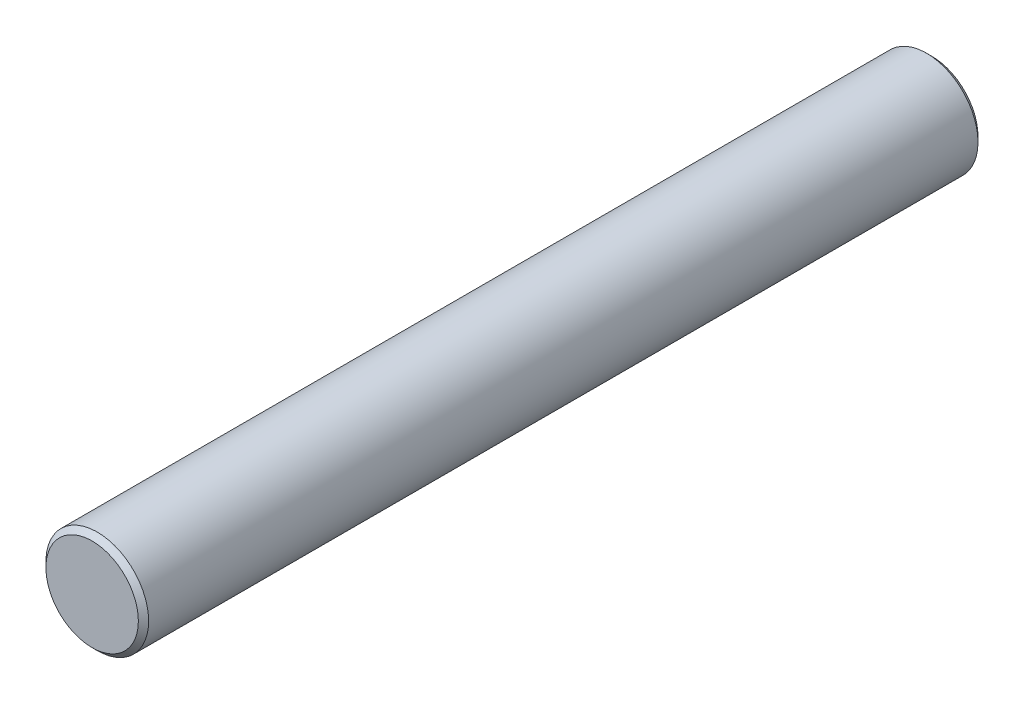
ISO-10303-21;
HEADER;
FILE_DESCRIPTION(('STEP AP214'),'2;1');
FILE_NAME('part.step','',(''),(''),'','','');
FILE_SCHEMA(('AUTOMOTIVE_DESIGN { 1 0 10303 214 1 1 1 1 }'));
ENDSEC;
DATA;
#1=APPLICATION_CONTEXT('core data for automotive mechanical design processes');
#2=APPLICATION_PROTOCOL_DEFINITION('international standard','automotive_design',2000,#1);
#3=PRODUCT_CONTEXT('',#1,'mechanical');
#4=PRODUCT('Part','Part','',(#3));
#5=PRODUCT_RELATED_PRODUCT_CATEGORY('part','',(#4));
#6=PRODUCT_DEFINITION_FORMATION('','',#4);
#7=PRODUCT_DEFINITION_CONTEXT('part definition',#1,'design');
#8=PRODUCT_DEFINITION('design','',#6,#7);
#9=PRODUCT_DEFINITION_SHAPE('','',#8);
#10=(LENGTH_UNIT() NAMED_UNIT(*) SI_UNIT(.MILLI.,.METRE.));
#11=(NAMED_UNIT(*) PLANE_ANGLE_UNIT() SI_UNIT($,.RADIAN.));
#12=(NAMED_UNIT(*) SI_UNIT($,.STERADIAN.) SOLID_ANGLE_UNIT());
#13=UNCERTAINTY_MEASURE_WITH_UNIT(LENGTH_MEASURE(1.E-05),#10,'distance_accuracy_value','');
#14=(GEOMETRIC_REPRESENTATION_CONTEXT(3) GLOBAL_UNCERTAINTY_ASSIGNED_CONTEXT((#13)) GLOBAL_UNIT_ASSIGNED_CONTEXT((#10,
#11,#12)) REPRESENTATION_CONTEXT('',''));
#15=CARTESIAN_POINT('',(0.,0.,0.));
#16=DIRECTION('',(0.,0.,1.));
#17=DIRECTION('',(1.,0.,0.));
#18=AXIS2_PLACEMENT_3D('',#15,#16,#17);
#19=CARTESIAN_POINT('',(0.,0.,-138.5));
#20=DIRECTION('',(0.,0.,1.));
#21=DIRECTION('',(1.,0.,0.));
#22=AXIS2_PLACEMENT_3D('',#19,#20,#21);
#23=CYLINDRICAL_SURFACE('',#22,6.99999999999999);
#24=CARTESIAN_POINT('',(0.,0.,-88.4999999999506));
#25=DIRECTION('',(0.,0.,1.));
#26=DIRECTION('',(1.,0.,0.));
#27=AXIS2_PLACEMENT_3D('',#24,#25,#26);
#28=CIRCLE('',#27,6.99999999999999);
#29=CARTESIAN_POINT('',(6.99999999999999,0.,-88.4999999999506));
#30=VERTEX_POINT('',#29);
#31=EDGE_CURVE('E11',#30,#30,#28,.T.);
#32=ORIENTED_EDGE('',*,*,#31,.T.);
#33=EDGE_LOOP('',(#32));
#34=FACE_BOUND('',#33,.T.);
#35=CARTESIAN_POINT('',(0.,0.,-138.293975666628));
#36=DIRECTION('',(0.,0.,1.));
#37=DIRECTION('',(1.,0.,0.));
#38=AXIS2_PLACEMENT_3D('',#35,#36,#37);
#39=CIRCLE('',#38,6.99999999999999);
#40=CARTESIAN_POINT('',(6.99999999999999,0.,-138.293975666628));
#41=VERTEX_POINT('',#40);
#42=EDGE_CURVE('E51',#41,#41,#39,.T.);
#43=ORIENTED_EDGE('',*,*,#42,.F.);
#44=EDGE_LOOP('',(#43));
#45=FACE_BOUND('',#44,.T.);
#46=ADVANCED_FACE('F32',(#34,#45),#23,.F.);
#47=CARTESIAN_POINT('',(0.,0.,-88.4999999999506));
#48=DIRECTION('',(0.,0.,-1.));
#49=DIRECTION('',(-1.,0.,0.));
#50=AXIS2_PLACEMENT_3D('',#47,#48,#49);
#51=CONICAL_SURFACE('',#50,6.99999999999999,1.02974425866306);
#52=CARTESIAN_POINT('',(0.,0.,-84.2939756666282));
#53=VERTEX_POINT('',#52);
#54=VERTEX_LOOP('',#53);
#55=FACE_BOUND('',#54,.T.);
#56=ORIENTED_EDGE('',*,*,#31,.F.);
#57=EDGE_LOOP('',(#56));
#58=FACE_BOUND('',#57,.T.);
#59=ADVANCED_FACE('F41',(#55,#58),#51,.F.);
#60=CARTESIAN_POINT('',(0.,0.,188.706024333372));
#61=DIRECTION('',(0.,0.,1.));
#62=DIRECTION('',(1.,0.,0.));
#63=AXIS2_PLACEMENT_3D('',#60,#61,#62);
#64=PLANE('',#63);
#65=CARTESIAN_POINT('',(0.,0.,188.706024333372));
#66=DIRECTION('',(0.,0.,1.));
#67=DIRECTION('',(1.,0.,0.));
#68=AXIS2_PLACEMENT_3D('',#65,#66,#67);
#69=CIRCLE('',#68,18.0000000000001);
#70=CARTESIAN_POINT('',(18.0000000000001,0.,188.706024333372));
#71=VERTEX_POINT('',#70);
#72=EDGE_CURVE('E38',#71,#71,#69,.T.);
#73=ORIENTED_EDGE('',*,*,#72,.T.);
#74=EDGE_LOOP('',(#73));
#75=FACE_BOUND('',#74,.T.);
#76=ADVANCED_FACE('F44',(#75),#64,.T.);
#77=CARTESIAN_POINT('',(0.,0.,188.706024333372));
#78=DIRECTION('',(0.,0.,-1.));
#79=DIRECTION('',(-1.,0.,0.));
#80=AXIS2_PLACEMENT_3D('',#77,#78,#79);
#81=CONICAL_SURFACE('',#80,18.0000000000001,0.785398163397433);
#82=CARTESIAN_POINT('',(0.,0.,186.706024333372));
#83=DIRECTION('',(0.,0.,1.));
#84=DIRECTION('',(1.,0.,0.));
#85=AXIS2_PLACEMENT_3D('',#82,#83,#84);
#86=CIRCLE('',#85,20.);
#87=CARTESIAN_POINT('',(20.,0.,186.706024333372));
#88=VERTEX_POINT('',#87);
#89=EDGE_CURVE('E61',#88,#88,#86,.T.);
#90=ORIENTED_EDGE('',*,*,#89,.T.);
#91=EDGE_LOOP('',(#90));
#92=FACE_BOUND('',#91,.T.);
#93=ORIENTED_EDGE('',*,*,#72,.F.);
#94=EDGE_LOOP('',(#93));
#95=FACE_BOUND('',#94,.T.);
#96=ADVANCED_FACE('F67',(#92,#95),#81,.T.);
#97=CARTESIAN_POINT('',(0.,0.,-138.5));
#98=DIRECTION('',(0.,0.,1.));
#99=DIRECTION('',(1.,0.,0.));
#100=AXIS2_PLACEMENT_3D('',#97,#98,#99);
#101=CYLINDRICAL_SURFACE('',#100,20.);
#102=CARTESIAN_POINT('',(0.,0.,-136.293975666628));
#103=DIRECTION('',(0.,0.,1.));
#104=DIRECTION('',(1.,0.,0.));
#105=AXIS2_PLACEMENT_3D('',#102,#103,#104);
#106=CIRCLE('',#105,20.);
#107=CARTESIAN_POINT('',(20.,0.,-136.293975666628));
#108=VERTEX_POINT('',#107);
#109=EDGE_CURVE('E56',#108,#108,#106,.T.);
#110=ORIENTED_EDGE('',*,*,#109,.T.);
#111=EDGE_LOOP('',(#110));
#112=FACE_BOUND('',#111,.T.);
#113=ORIENTED_EDGE('',*,*,#89,.F.);
#114=EDGE_LOOP('',(#113));
#115=FACE_BOUND('',#114,.T.);
#116=ADVANCED_FACE('F69',(#112,#115),#101,.T.);
#117=CARTESIAN_POINT('',(0.,0.,-136.293975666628));
#118=DIRECTION('',(0.,0.,1.));
#119=DIRECTION('',(1.,0.,0.));
#120=AXIS2_PLACEMENT_3D('',#117,#118,#119);
#121=CONICAL_SURFACE('',#120,20.,0.785398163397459);
#122=CARTESIAN_POINT('',(0.,0.,-138.293975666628));
#123=DIRECTION('',(0.,0.,1.));
#124=DIRECTION('',(1.,0.,0.));
#125=AXIS2_PLACEMENT_3D('',#122,#123,#124);
#126=CIRCLE('',#125,18.);
#127=CARTESIAN_POINT('',(18.,0.,-138.293975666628));
#128=VERTEX_POINT('',#127);
#129=EDGE_CURVE('E53',#128,#128,#126,.T.);
#130=ORIENTED_EDGE('',*,*,#129,.T.);
#131=EDGE_LOOP('',(#130));
#132=FACE_BOUND('',#131,.T.);
#133=ORIENTED_EDGE('',*,*,#109,.F.);
#134=EDGE_LOOP('',(#133));
#135=FACE_BOUND('',#134,.T.);
#136=ADVANCED_FACE('F76',(#132,#135),#121,.T.);
#137=CARTESIAN_POINT('',(18.,0.,-138.293975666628));
#138=DIRECTION('',(0.,0.,-1.));
#139=DIRECTION('',(-1.,0.,0.));
#140=AXIS2_PLACEMENT_3D('',#137,#138,#139);
#141=PLANE('',#140);
#142=ORIENTED_EDGE('',*,*,#42,.T.);
#143=EDGE_LOOP('',(#142));
#144=FACE_BOUND('',#143,.T.);
#145=ORIENTED_EDGE('',*,*,#129,.F.);
#146=EDGE_LOOP('',(#145));
#147=FACE_BOUND('',#146,.T.);
#148=ADVANCED_FACE('F83',(#144,#147),#141,.T.);
#149=CLOSED_SHELL('',(#46,#59,#76,#96,#116,#136,#148));
#150=MANIFOLD_SOLID_BREP('B2',#149);
#151=ADVANCED_BREP_SHAPE_REPRESENTATION('',(#18,#150),#14);
#152=SHAPE_DEFINITION_REPRESENTATION(#9,#151);
ENDSEC;
END-ISO-10303-21;
